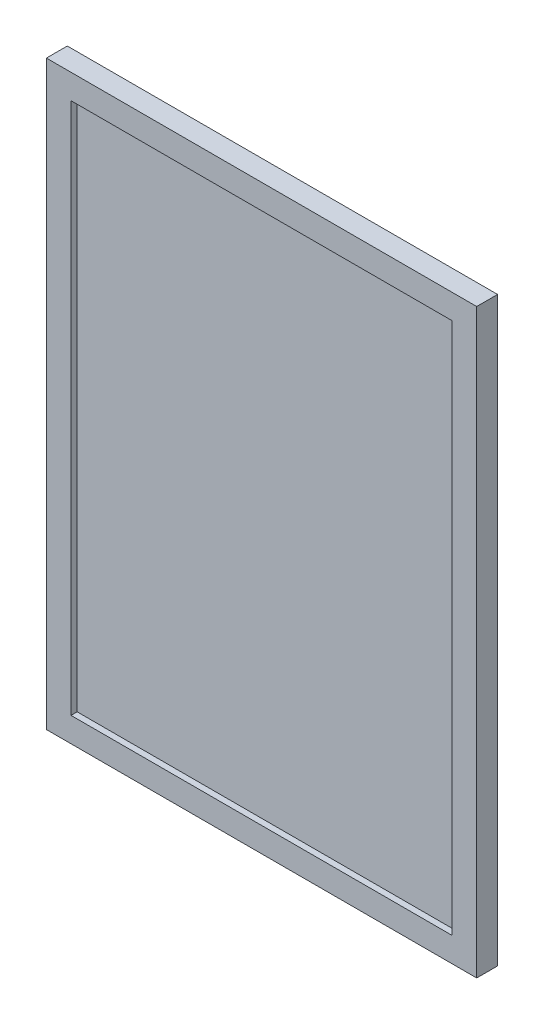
ISO-10303-21;
HEADER;
FILE_DESCRIPTION(('STEP AP214'),'2;1');
FILE_NAME('part.step','',(''),(''),'','','');
FILE_SCHEMA(('AUTOMOTIVE_DESIGN { 1 0 10303 214 1 1 1 1 }'));
ENDSEC;
DATA;
#1=APPLICATION_CONTEXT('core data for automotive mechanical design processes');
#2=APPLICATION_PROTOCOL_DEFINITION('international standard','automotive_design',2000,#1);
#3=PRODUCT_CONTEXT('',#1,'mechanical');
#4=PRODUCT('Part','Part','',(#3));
#5=PRODUCT_RELATED_PRODUCT_CATEGORY('part','',(#4));
#6=PRODUCT_DEFINITION_FORMATION('','',#4);
#7=PRODUCT_DEFINITION_CONTEXT('part definition',#1,'design');
#8=PRODUCT_DEFINITION('design','',#6,#7);
#9=PRODUCT_DEFINITION_SHAPE('','',#8);
#10=(LENGTH_UNIT() NAMED_UNIT(*) SI_UNIT(.MILLI.,.METRE.));
#11=(NAMED_UNIT(*) PLANE_ANGLE_UNIT() SI_UNIT($,.RADIAN.));
#12=(NAMED_UNIT(*) SI_UNIT($,.STERADIAN.) SOLID_ANGLE_UNIT());
#13=UNCERTAINTY_MEASURE_WITH_UNIT(LENGTH_MEASURE(1.E-05),#10,'distance_accuracy_value','');
#14=(GEOMETRIC_REPRESENTATION_CONTEXT(3) GLOBAL_UNCERTAINTY_ASSIGNED_CONTEXT((#13)) GLOBAL_UNIT_ASSIGNED_CONTEXT((#10,
#11,#12)) REPRESENTATION_CONTEXT('',''));
#15=CARTESIAN_POINT('',(0.,0.,0.));
#16=DIRECTION('',(0.,0.,1.));
#17=DIRECTION('',(1.,0.,0.));
#18=AXIS2_PLACEMENT_3D('',#15,#16,#17);
#19=CARTESIAN_POINT('',(0.,0.,17.));
#20=DIRECTION('',(1.,0.,0.));
#21=DIRECTION('',(0.,0.,-1.));
#22=AXIS2_PLACEMENT_3D('',#19,#20,#21);
#23=PLANE('',#22);
#24=DIRECTION('',(0.,-1.,0.));
#25=VECTOR('',#24,1.);
#26=CARTESIAN_POINT('',(0.,0.,0.));
#27=LINE('',#26,#25);
#28=CARTESIAN_POINT('',(0.,473.,0.));
#29=VERTEX_POINT('',#28);
#30=CARTESIAN_POINT('',(0.,0.,0.));
#31=VERTEX_POINT('',#30);
#32=EDGE_CURVE('E202',#29,#31,#27,.T.);
#33=ORIENTED_EDGE('',*,*,#32,.T.);
#34=DIRECTION('',(0.,0.,-1.));
#35=VECTOR('',#34,1.);
#36=CARTESIAN_POINT('',(0.,0.,17.));
#37=LINE('',#36,#35);
#38=CARTESIAN_POINT('',(0.,0.,17.));
#39=VERTEX_POINT('',#38);
#40=EDGE_CURVE('E11',#39,#31,#37,.T.);
#41=ORIENTED_EDGE('',*,*,#40,.F.);
#42=DIRECTION('',(0.,-1.,0.));
#43=VECTOR('',#42,1.);
#44=CARTESIAN_POINT('',(0.,0.,17.));
#45=LINE('',#44,#43);
#46=CARTESIAN_POINT('',(0.,473.,17.));
#47=VERTEX_POINT('',#46);
#48=EDGE_CURVE('E208',#47,#39,#45,.T.);
#49=ORIENTED_EDGE('',*,*,#48,.F.);
#50=DIRECTION('',(0.,0.,-1.));
#51=VECTOR('',#50,1.);
#52=CARTESIAN_POINT('',(0.,473.,17.));
#53=LINE('',#52,#51);
#54=EDGE_CURVE('E218',#47,#29,#53,.T.);
#55=ORIENTED_EDGE('',*,*,#54,.T.);
#56=EDGE_LOOP('',(#33,#41,#49,#55));
#57=FACE_BOUND('',#56,.T.);
#58=ADVANCED_FACE('F51',(#57),#23,.F.);
#59=CARTESIAN_POINT('',(0.,0.,17.));
#60=DIRECTION('',(0.,1.,0.));
#61=DIRECTION('',(0.,0.,1.));
#62=AXIS2_PLACEMENT_3D('',#59,#60,#61);
#63=PLANE('',#62);
#64=DIRECTION('',(1.,0.,0.));
#65=VECTOR('',#64,1.);
#66=CARTESIAN_POINT('',(0.,0.,0.));
#67=LINE('',#66,#65);
#68=CARTESIAN_POINT('',(350.,0.,0.));
#69=VERTEX_POINT('',#68);
#70=EDGE_CURVE('E221',#31,#69,#67,.T.);
#71=ORIENTED_EDGE('',*,*,#70,.T.);
#72=DIRECTION('',(0.,0.,-1.));
#73=VECTOR('',#72,1.);
#74=CARTESIAN_POINT('',(350.,0.,17.));
#75=LINE('',#74,#73);
#76=CARTESIAN_POINT('',(350.,0.,17.));
#77=VERTEX_POINT('',#76);
#78=EDGE_CURVE('E58',#77,#69,#75,.T.);
#79=ORIENTED_EDGE('',*,*,#78,.F.);
#80=DIRECTION('',(1.,0.,0.));
#81=VECTOR('',#80,1.);
#82=CARTESIAN_POINT('',(0.,0.,17.));
#83=LINE('',#82,#81);
#84=EDGE_CURVE('E211',#39,#77,#83,.T.);
#85=ORIENTED_EDGE('',*,*,#84,.F.);
#86=ORIENTED_EDGE('',*,*,#40,.T.);
#87=EDGE_LOOP('',(#71,#79,#85,#86));
#88=FACE_BOUND('',#87,.T.);
#89=ADVANCED_FACE('F251',(#88),#63,.F.);
#90=CARTESIAN_POINT('',(350.,0.,17.));
#91=DIRECTION('',(-1.,0.,0.));
#92=DIRECTION('',(0.,0.,1.));
#93=AXIS2_PLACEMENT_3D('',#90,#91,#92);
#94=PLANE('',#93);
#95=DIRECTION('',(0.,1.,0.));
#96=VECTOR('',#95,1.);
#97=CARTESIAN_POINT('',(350.,0.,0.));
#98=LINE('',#97,#96);
#99=CARTESIAN_POINT('',(350.,473.,0.));
#100=VERTEX_POINT('',#99);
#101=EDGE_CURVE('E223',#69,#100,#98,.T.);
#102=ORIENTED_EDGE('',*,*,#101,.T.);
#103=DIRECTION('',(0.,0.,-1.));
#104=VECTOR('',#103,1.);
#105=CARTESIAN_POINT('',(350.,473.,17.));
#106=LINE('',#105,#104);
#107=CARTESIAN_POINT('',(350.,473.,17.));
#108=VERTEX_POINT('',#107);
#109=EDGE_CURVE('E228',#108,#100,#106,.T.);
#110=ORIENTED_EDGE('',*,*,#109,.F.);
#111=DIRECTION('',(0.,1.,0.));
#112=VECTOR('',#111,1.);
#113=CARTESIAN_POINT('',(350.,0.,17.));
#114=LINE('',#113,#112);
#115=EDGE_CURVE('E214',#77,#108,#114,.T.);
#116=ORIENTED_EDGE('',*,*,#115,.F.);
#117=ORIENTED_EDGE('',*,*,#78,.T.);
#118=EDGE_LOOP('',(#102,#110,#116,#117));
#119=FACE_BOUND('',#118,.T.);
#120=ADVANCED_FACE('F235',(#119),#94,.F.);
#121=CARTESIAN_POINT('',(0.,473.,17.));
#122=DIRECTION('',(0.,-1.,0.));
#123=DIRECTION('',(0.,0.,-1.));
#124=AXIS2_PLACEMENT_3D('',#121,#122,#123);
#125=PLANE('',#124);
#126=DIRECTION('',(-1.,0.,0.));
#127=VECTOR('',#126,1.);
#128=CARTESIAN_POINT('',(0.,473.,0.));
#129=LINE('',#128,#127);
#130=EDGE_CURVE('E212',#100,#29,#129,.T.);
#131=ORIENTED_EDGE('',*,*,#130,.T.);
#132=ORIENTED_EDGE('',*,*,#54,.F.);
#133=DIRECTION('',(-1.,0.,0.));
#134=VECTOR('',#133,1.);
#135=CARTESIAN_POINT('',(0.,473.,17.));
#136=LINE('',#135,#134);
#137=EDGE_CURVE('E216',#108,#47,#136,.T.);
#138=ORIENTED_EDGE('',*,*,#137,.F.);
#139=ORIENTED_EDGE('',*,*,#109,.T.);
#140=EDGE_LOOP('',(#131,#132,#138,#139));
#141=FACE_BOUND('',#140,.T.);
#142=ADVANCED_FACE('F244',(#141),#125,.F.);
#143=CARTESIAN_POINT('',(0.,0.,17.));
#144=DIRECTION('',(0.,0.,-1.));
#145=DIRECTION('',(-1.,0.,0.));
#146=AXIS2_PLACEMENT_3D('',#143,#144,#145);
#147=PLANE('',#146);
#148=DIRECTION('',(1.,0.,0.));
#149=VECTOR('',#148,1.);
#150=CARTESIAN_POINT('',(20.0000000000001,20.,17.));
#151=LINE('',#150,#149);
#152=CARTESIAN_POINT('',(20.0000000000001,20.,17.));
#153=VERTEX_POINT('',#152);
#154=CARTESIAN_POINT('',(330.,20.,17.));
#155=VERTEX_POINT('',#154);
#156=EDGE_CURVE('E168',#153,#155,#151,.T.);
#157=ORIENTED_EDGE('',*,*,#156,.F.);
#158=DIRECTION('',(0.,-1.,0.));
#159=VECTOR('',#158,1.);
#160=CARTESIAN_POINT('',(20.,453.,17.));
#161=LINE('',#160,#159);
#162=CARTESIAN_POINT('',(20.,453.,17.));
#163=VERTEX_POINT('',#162);
#164=EDGE_CURVE('E65',#163,#153,#161,.T.);
#165=ORIENTED_EDGE('',*,*,#164,.F.);
#166=DIRECTION('',(-1.,0.,0.));
#167=VECTOR('',#166,1.);
#168=CARTESIAN_POINT('',(20.,453.,17.));
#169=LINE('',#168,#167);
#170=CARTESIAN_POINT('',(330.,453.,17.));
#171=VERTEX_POINT('',#170);
#172=EDGE_CURVE('E159',#171,#163,#169,.T.);
#173=ORIENTED_EDGE('',*,*,#172,.F.);
#174=DIRECTION('',(0.,1.,0.));
#175=VECTOR('',#174,1.);
#176=CARTESIAN_POINT('',(330.,453.,17.));
#177=LINE('',#176,#175);
#178=EDGE_CURVE('E162',#155,#171,#177,.T.);
#179=ORIENTED_EDGE('',*,*,#178,.F.);
#180=EDGE_LOOP('',(#157,#165,#173,#179));
#181=FACE_BOUND('',#180,.T.);
#182=ORIENTED_EDGE('',*,*,#48,.T.);
#183=ORIENTED_EDGE('',*,*,#84,.T.);
#184=ORIENTED_EDGE('',*,*,#115,.T.);
#185=ORIENTED_EDGE('',*,*,#137,.T.);
#186=EDGE_LOOP('',(#182,#183,#184,#185));
#187=FACE_BOUND('',#186,.T.);
#188=ADVANCED_FACE('F250',(#181,#187),#147,.F.);
#189=CARTESIAN_POINT('',(0.,0.,0.));
#190=DIRECTION('',(0.,0.,-1.));
#191=DIRECTION('',(-1.,0.,0.));
#192=AXIS2_PLACEMENT_3D('',#189,#190,#191);
#193=PLANE('',#192);
#194=DIRECTION('',(0.,-1.,0.));
#195=VECTOR('',#194,1.);
#196=CARTESIAN_POINT('',(330.,453.,0.));
#197=LINE('',#196,#195);
#198=CARTESIAN_POINT('',(330.,453.,0.));
#199=VERTEX_POINT('',#198);
#200=CARTESIAN_POINT('',(330.,20.,0.));
#201=VERTEX_POINT('',#200);
#202=EDGE_CURVE('E73',#199,#201,#197,.T.);
#203=ORIENTED_EDGE('',*,*,#202,.F.);
#204=DIRECTION('',(1.,0.,0.));
#205=VECTOR('',#204,1.);
#206=CARTESIAN_POINT('',(330.,453.,0.));
#207=LINE('',#206,#205);
#208=CARTESIAN_POINT('',(20.,453.,0.));
#209=VERTEX_POINT('',#208);
#210=EDGE_CURVE('E181',#209,#199,#207,.T.);
#211=ORIENTED_EDGE('',*,*,#210,.F.);
#212=DIRECTION('',(0.,1.,0.));
#213=VECTOR('',#212,1.);
#214=CARTESIAN_POINT('',(20.,453.,0.));
#215=LINE('',#214,#213);
#216=CARTESIAN_POINT('',(20.,20.,0.));
#217=VERTEX_POINT('',#216);
#218=EDGE_CURVE('E195',#217,#209,#215,.T.);
#219=ORIENTED_EDGE('',*,*,#218,.F.);
#220=DIRECTION('',(-1.,0.,0.));
#221=VECTOR('',#220,1.);
#222=CARTESIAN_POINT('',(330.,20.,0.));
#223=LINE('',#222,#221);
#224=EDGE_CURVE('E192',#201,#217,#223,.T.);
#225=ORIENTED_EDGE('',*,*,#224,.F.);
#226=EDGE_LOOP('',(#203,#211,#219,#225));
#227=FACE_BOUND('',#226,.T.);
#228=ORIENTED_EDGE('',*,*,#32,.F.);
#229=ORIENTED_EDGE('',*,*,#130,.F.);
#230=ORIENTED_EDGE('',*,*,#101,.F.);
#231=ORIENTED_EDGE('',*,*,#70,.F.);
#232=EDGE_LOOP('',(#228,#229,#230,#231));
#233=FACE_BOUND('',#232,.T.);
#234=ADVANCED_FACE('F241',(#227,#233),#193,.T.);
#235=CARTESIAN_POINT('',(330.,453.,5.));
#236=DIRECTION('',(1.,0.,0.));
#237=DIRECTION('',(0.,1.,0.));
#238=AXIS2_PLACEMENT_3D('',#235,#236,#237);
#239=PLANE('',#238);
#240=ORIENTED_EDGE('',*,*,#202,.T.);
#241=DIRECTION('',(0.,0.,-1.));
#242=VECTOR('',#241,1.);
#243=CARTESIAN_POINT('',(330.,20.,5.));
#244=LINE('',#243,#242);
#245=CARTESIAN_POINT('',(330.,20.,5.));
#246=VERTEX_POINT('',#245);
#247=EDGE_CURVE('E190',#246,#201,#244,.T.);
#248=ORIENTED_EDGE('',*,*,#247,.F.);
#249=DIRECTION('',(0.,-1.,0.));
#250=VECTOR('',#249,1.);
#251=CARTESIAN_POINT('',(330.,453.,5.));
#252=LINE('',#251,#250);
#253=CARTESIAN_POINT('',(330.,453.,5.));
#254=VERTEX_POINT('',#253);
#255=EDGE_CURVE('E177',#254,#246,#252,.T.);
#256=ORIENTED_EDGE('',*,*,#255,.F.);
#257=DIRECTION('',(0.,0.,-1.));
#258=VECTOR('',#257,1.);
#259=CARTESIAN_POINT('',(330.,453.,5.));
#260=LINE('',#259,#258);
#261=EDGE_CURVE('E200',#254,#199,#260,.T.);
#262=ORIENTED_EDGE('',*,*,#261,.T.);
#263=EDGE_LOOP('',(#240,#248,#256,#262));
#264=FACE_BOUND('',#263,.T.);
#265=ADVANCED_FACE('F263',(#264),#239,.F.);
#266=CARTESIAN_POINT('',(330.,453.,5.));
#267=DIRECTION('',(0.,1.,0.));
#268=DIRECTION('',(0.,0.,1.));
#269=AXIS2_PLACEMENT_3D('',#266,#267,#268);
#270=PLANE('',#269);
#271=ORIENTED_EDGE('',*,*,#210,.T.);
#272=ORIENTED_EDGE('',*,*,#261,.F.);
#273=DIRECTION('',(1.,0.,0.));
#274=VECTOR('',#273,1.);
#275=CARTESIAN_POINT('',(330.,453.,5.));
#276=LINE('',#275,#274);
#277=CARTESIAN_POINT('',(20.,453.,5.));
#278=VERTEX_POINT('',#277);
#279=EDGE_CURVE('E187',#278,#254,#276,.T.);
#280=ORIENTED_EDGE('',*,*,#279,.F.);
#281=DIRECTION('',(0.,0.,-1.));
#282=VECTOR('',#281,1.);
#283=CARTESIAN_POINT('',(20.,453.,5.));
#284=LINE('',#283,#282);
#285=EDGE_CURVE('E203',#278,#209,#284,.T.);
#286=ORIENTED_EDGE('',*,*,#285,.T.);
#287=EDGE_LOOP('',(#271,#272,#280,#286));
#288=FACE_BOUND('',#287,.T.);
#289=ADVANCED_FACE('F270',(#288),#270,.F.);
#290=CARTESIAN_POINT('',(20.,453.,5.));
#291=DIRECTION('',(-1.,0.,0.));
#292=DIRECTION('',(0.,-1.,0.));
#293=AXIS2_PLACEMENT_3D('',#290,#291,#292);
#294=PLANE('',#293);
#295=ORIENTED_EDGE('',*,*,#218,.T.);
#296=ORIENTED_EDGE('',*,*,#285,.F.);
#297=DIRECTION('',(0.,1.,0.));
#298=VECTOR('',#297,1.);
#299=CARTESIAN_POINT('',(20.,453.,5.));
#300=LINE('',#299,#298);
#301=CARTESIAN_POINT('',(20.,20.,5.));
#302=VERTEX_POINT('',#301);
#303=EDGE_CURVE('E184',#302,#278,#300,.T.);
#304=ORIENTED_EDGE('',*,*,#303,.F.);
#305=DIRECTION('',(0.,0.,-1.));
#306=VECTOR('',#305,1.);
#307=CARTESIAN_POINT('',(20.,20.,5.));
#308=LINE('',#307,#306);
#309=EDGE_CURVE('E205',#302,#217,#308,.T.);
#310=ORIENTED_EDGE('',*,*,#309,.T.);
#311=EDGE_LOOP('',(#295,#296,#304,#310));
#312=FACE_BOUND('',#311,.T.);
#313=ADVANCED_FACE('F275',(#312),#294,.F.);
#314=CARTESIAN_POINT('',(330.,20.,5.));
#315=DIRECTION('',(0.,-1.,0.));
#316=DIRECTION('',(0.,0.,-1.));
#317=AXIS2_PLACEMENT_3D('',#314,#315,#316);
#318=PLANE('',#317);
#319=ORIENTED_EDGE('',*,*,#224,.T.);
#320=ORIENTED_EDGE('',*,*,#309,.F.);
#321=DIRECTION('',(-1.,0.,0.));
#322=VECTOR('',#321,1.);
#323=CARTESIAN_POINT('',(330.,20.,5.));
#324=LINE('',#323,#322);
#325=EDGE_CURVE('E180',#246,#302,#324,.T.);
#326=ORIENTED_EDGE('',*,*,#325,.F.);
#327=ORIENTED_EDGE('',*,*,#247,.T.);
#328=EDGE_LOOP('',(#319,#320,#326,#327));
#329=FACE_BOUND('',#328,.T.);
#330=ADVANCED_FACE('F271',(#329),#318,.F.);
#331=CARTESIAN_POINT('',(0.,0.,5.));
#332=DIRECTION('',(0.,0.,-1.));
#333=DIRECTION('',(-1.,0.,0.));
#334=AXIS2_PLACEMENT_3D('',#331,#332,#333);
#335=PLANE('',#334);
#336=ORIENTED_EDGE('',*,*,#255,.T.);
#337=ORIENTED_EDGE('',*,*,#325,.T.);
#338=ORIENTED_EDGE('',*,*,#303,.T.);
#339=ORIENTED_EDGE('',*,*,#279,.T.);
#340=EDGE_LOOP('',(#336,#337,#338,#339));
#341=FACE_BOUND('',#340,.T.);
#342=ADVANCED_FACE('F274',(#341),#335,.T.);
#343=CARTESIAN_POINT('',(20.,453.,12.));
#344=DIRECTION('',(-1.,0.,0.));
#345=DIRECTION('',(0.,-1.,0.));
#346=AXIS2_PLACEMENT_3D('',#343,#344,#345);
#347=PLANE('',#346);
#348=ORIENTED_EDGE('',*,*,#164,.T.);
#349=DIRECTION('',(0.,0.,1.));
#350=VECTOR('',#349,1.);
#351=CARTESIAN_POINT('',(20.0000000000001,20.,12.));
#352=LINE('',#351,#350);
#353=CARTESIAN_POINT('',(20.0000000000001,20.,12.));
#354=VERTEX_POINT('',#353);
#355=EDGE_CURVE('E137',#354,#153,#352,.T.);
#356=ORIENTED_EDGE('',*,*,#355,.F.);
#357=DIRECTION('',(0.,-1.,0.));
#358=VECTOR('',#357,1.);
#359=CARTESIAN_POINT('',(20.,453.,12.));
#360=LINE('',#359,#358);
#361=CARTESIAN_POINT('',(20.,453.,12.));
#362=VERTEX_POINT('',#361);
#363=EDGE_CURVE('E141',#362,#354,#360,.T.);
#364=ORIENTED_EDGE('',*,*,#363,.F.);
#365=DIRECTION('',(0.,0.,1.));
#366=VECTOR('',#365,1.);
#367=CARTESIAN_POINT('',(20.,453.,12.));
#368=LINE('',#367,#366);
#369=EDGE_CURVE('E172',#362,#163,#368,.T.);
#370=ORIENTED_EDGE('',*,*,#369,.T.);
#371=EDGE_LOOP('',(#348,#356,#364,#370));
#372=FACE_BOUND('',#371,.T.);
#373=ADVANCED_FACE('F139',(#372),#347,.F.);
#374=CARTESIAN_POINT('',(20.,453.,12.));
#375=DIRECTION('',(0.,1.,0.));
#376=DIRECTION('',(0.,0.,1.));
#377=AXIS2_PLACEMENT_3D('',#374,#375,#376);
#378=PLANE('',#377);
#379=ORIENTED_EDGE('',*,*,#172,.T.);
#380=ORIENTED_EDGE('',*,*,#369,.F.);
#381=DIRECTION('',(-1.,0.,0.));
#382=VECTOR('',#381,1.);
#383=CARTESIAN_POINT('',(20.,453.,12.));
#384=LINE('',#383,#382);
#385=CARTESIAN_POINT('',(330.,453.,12.));
#386=VERTEX_POINT('',#385);
#387=EDGE_CURVE('E147',#386,#362,#384,.T.);
#388=ORIENTED_EDGE('',*,*,#387,.F.);
#389=DIRECTION('',(0.,0.,1.));
#390=VECTOR('',#389,1.);
#391=CARTESIAN_POINT('',(330.,453.,12.));
#392=LINE('',#391,#390);
#393=EDGE_CURVE('E174',#386,#171,#392,.T.);
#394=ORIENTED_EDGE('',*,*,#393,.T.);
#395=EDGE_LOOP('',(#379,#380,#388,#394));
#396=FACE_BOUND('',#395,.T.);
#397=ADVANCED_FACE('F288',(#396),#378,.F.);
#398=CARTESIAN_POINT('',(330.,453.,12.));
#399=DIRECTION('',(1.,0.,0.));
#400=DIRECTION('',(0.,1.,0.));
#401=AXIS2_PLACEMENT_3D('',#398,#399,#400);
#402=PLANE('',#401);
#403=ORIENTED_EDGE('',*,*,#178,.T.);
#404=ORIENTED_EDGE('',*,*,#393,.F.);
#405=DIRECTION('',(0.,1.,0.));
#406=VECTOR('',#405,1.);
#407=CARTESIAN_POINT('',(330.,453.,12.));
#408=LINE('',#407,#406);
#409=CARTESIAN_POINT('',(330.,20.,12.));
#410=VERTEX_POINT('',#409);
#411=EDGE_CURVE('E155',#410,#386,#408,.T.);
#412=ORIENTED_EDGE('',*,*,#411,.F.);
#413=DIRECTION('',(0.,0.,1.));
#414=VECTOR('',#413,1.);
#415=CARTESIAN_POINT('',(330.,20.,12.));
#416=LINE('',#415,#414);
#417=EDGE_CURVE('E146',#410,#155,#416,.T.);
#418=ORIENTED_EDGE('',*,*,#417,.T.);
#419=EDGE_LOOP('',(#403,#404,#412,#418));
#420=FACE_BOUND('',#419,.T.);
#421=ADVANCED_FACE('F291',(#420),#402,.F.);
#422=CARTESIAN_POINT('',(20.0000000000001,20.,12.));
#423=DIRECTION('',(0.,-1.,0.));
#424=DIRECTION('',(0.,0.,-1.));
#425=AXIS2_PLACEMENT_3D('',#422,#423,#424);
#426=PLANE('',#425);
#427=ORIENTED_EDGE('',*,*,#156,.T.);
#428=ORIENTED_EDGE('',*,*,#417,.F.);
#429=DIRECTION('',(1.,0.,0.));
#430=VECTOR('',#429,1.);
#431=CARTESIAN_POINT('',(20.0000000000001,20.,12.));
#432=LINE('',#431,#430);
#433=EDGE_CURVE('E150',#354,#410,#432,.T.);
#434=ORIENTED_EDGE('',*,*,#433,.F.);
#435=ORIENTED_EDGE('',*,*,#355,.T.);
#436=EDGE_LOOP('',(#427,#428,#434,#435));
#437=FACE_BOUND('',#436,.T.);
#438=ADVANCED_FACE('F151',(#437),#426,.F.);
#439=CARTESIAN_POINT('',(0.,0.,12.));
#440=DIRECTION('',(0.,0.,1.));
#441=DIRECTION('',(1.,0.,0.));
#442=AXIS2_PLACEMENT_3D('',#439,#440,#441);
#443=PLANE('',#442);
#444=ORIENTED_EDGE('',*,*,#363,.T.);
#445=ORIENTED_EDGE('',*,*,#433,.T.);
#446=ORIENTED_EDGE('',*,*,#411,.T.);
#447=ORIENTED_EDGE('',*,*,#387,.T.);
#448=EDGE_LOOP('',(#444,#445,#446,#447));
#449=FACE_BOUND('',#448,.T.);
#450=ADVANCED_FACE('F157',(#449),#443,.T.);
#451=CLOSED_SHELL('',(#58,#89,#120,#142,#188,#234,#265,#289,#313,#330,#342,#373,#397,#421,#438,#450));
#452=MANIFOLD_SOLID_BREP('B2',#451);
#453=ADVANCED_BREP_SHAPE_REPRESENTATION('',(#18,#452),#14);
#454=SHAPE_DEFINITION_REPRESENTATION(#9,#453);
ENDSEC;
END-ISO-10303-21;
